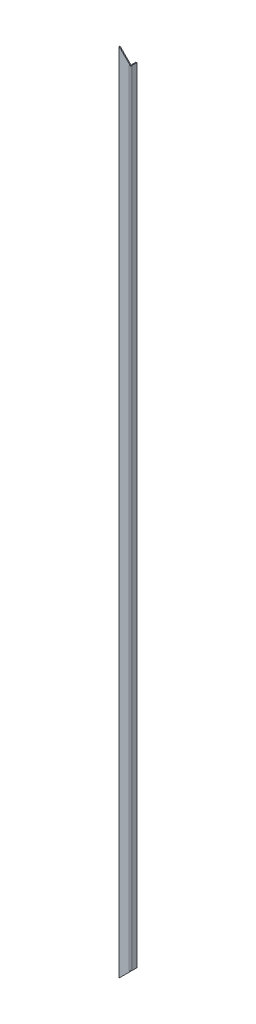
ISO-10303-21;
HEADER;
FILE_DESCRIPTION(('STEP AP214'),'2;1');
FILE_NAME('part.step','',(''),(''),'','','');
FILE_SCHEMA(('AUTOMOTIVE_DESIGN { 1 0 10303 214 1 1 1 1 }'));
ENDSEC;
DATA;
#1=APPLICATION_CONTEXT('core data for automotive mechanical design processes');
#2=APPLICATION_PROTOCOL_DEFINITION('international standard','automotive_design',2000,#1);
#3=PRODUCT_CONTEXT('',#1,'mechanical');
#4=PRODUCT('Part','Part','',(#3));
#5=PRODUCT_RELATED_PRODUCT_CATEGORY('part','',(#4));
#6=PRODUCT_DEFINITION_FORMATION('','',#4);
#7=PRODUCT_DEFINITION_CONTEXT('part definition',#1,'design');
#8=PRODUCT_DEFINITION('design','',#6,#7);
#9=PRODUCT_DEFINITION_SHAPE('','',#8);
#10=(LENGTH_UNIT() NAMED_UNIT(*) SI_UNIT(.MILLI.,.METRE.));
#11=(NAMED_UNIT(*) PLANE_ANGLE_UNIT() SI_UNIT($,.RADIAN.));
#12=(NAMED_UNIT(*) SI_UNIT($,.STERADIAN.) SOLID_ANGLE_UNIT());
#13=UNCERTAINTY_MEASURE_WITH_UNIT(LENGTH_MEASURE(1.E-05),#10,'distance_accuracy_value','');
#14=(GEOMETRIC_REPRESENTATION_CONTEXT(3) GLOBAL_UNCERTAINTY_ASSIGNED_CONTEXT((#13)) GLOBAL_UNIT_ASSIGNED_CONTEXT((#10,
#11,#12)) REPRESENTATION_CONTEXT('',''));
#15=CARTESIAN_POINT('',(0.,0.,0.));
#16=DIRECTION('',(0.,0.,1.));
#17=DIRECTION('',(1.,0.,0.));
#18=AXIS2_PLACEMENT_3D('',#15,#16,#17);
#19=CARTESIAN_POINT('',(-145.499999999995,-689.5,0.));
#20=DIRECTION('',(0.,1.,0.));
#21=DIRECTION('',(0.,0.,1.));
#22=AXIS2_PLACEMENT_3D('',#19,#20,#21);
#23=PLANE('',#22);
#24=DIRECTION('',(-1.,0.,0.));
#25=VECTOR('',#24,1.);
#26=CARTESIAN_POINT('',(-145.499999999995,-689.5,0.));
#27=LINE('',#26,#25);
#28=CARTESIAN_POINT('',(-145.499999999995,-689.5,0.));
#29=VERTEX_POINT('',#28);
#30=CARTESIAN_POINT('',(-145.708712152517,-689.5,0.));
#31=VERTEX_POINT('',#30);
#32=EDGE_CURVE('E206',#29,#31,#27,.T.);
#33=ORIENTED_EDGE('',*,*,#32,.T.);
#34=CARTESIAN_POINT('',(-147.999999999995,-689.5,-1.00000000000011));
#35=DIRECTION('',(0.,-1.,0.));
#36=DIRECTION('',(0.,0.,-1.));
#37=AXIS2_PLACEMENT_3D('',#34,#35,#36);
#38=CIRCLE('',#37,2.5);
#39=CARTESIAN_POINT('',(-147.999999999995,-689.5,1.5));
#40=VERTEX_POINT('',#39);
#41=EDGE_CURVE('E13',#31,#40,#38,.T.);
#42=ORIENTED_EDGE('',*,*,#41,.T.);
#43=DIRECTION('',(-1.,0.,0.));
#44=VECTOR('',#43,1.);
#45=CARTESIAN_POINT('',(0.,-689.5,1.5));
#46=LINE('',#45,#44);
#47=CARTESIAN_POINT('',(-145.499999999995,-689.5,1.5));
#48=VERTEX_POINT('',#47);
#49=EDGE_CURVE('E213',#48,#40,#46,.T.);
#50=ORIENTED_EDGE('',*,*,#49,.F.);
#51=DIRECTION('',(0.,0.,-1.));
#52=VECTOR('',#51,1.);
#53=CARTESIAN_POINT('',(-145.499999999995,-689.5,1.5));
#54=LINE('',#53,#52);
#55=EDGE_CURVE('E223',#48,#29,#54,.T.);
#56=ORIENTED_EDGE('',*,*,#55,.T.);
#57=EDGE_LOOP('',(#33,#42,#50,#56));
#58=FACE_BOUND('',#57,.T.);
#59=ADVANCED_FACE('F58',(#58),#23,.T.);
#60=CARTESIAN_POINT('',(-147.999999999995,689.499999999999,0.));
#61=DIRECTION('',(0.,-1.,0.));
#62=DIRECTION('',(1.,0.,0.));
#63=AXIS2_PLACEMENT_3D('',#60,#61,#62);
#64=PLANE('',#63);
#65=DIRECTION('',(1.,0.,0.));
#66=VECTOR('',#65,1.);
#67=CARTESIAN_POINT('',(-3.0619951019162E-11,689.500000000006,1.5));
#68=LINE('',#67,#66);
#69=CARTESIAN_POINT('',(-147.999999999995,689.499999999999,1.5));
#70=VERTEX_POINT('',#69);
#71=CARTESIAN_POINT('',(-145.499999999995,689.499999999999,1.5));
#72=VERTEX_POINT('',#71);
#73=EDGE_CURVE('E208',#70,#72,#68,.T.);
#74=ORIENTED_EDGE('',*,*,#73,.F.);
#75=CARTESIAN_POINT('',(-147.999999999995,689.499999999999,-0.999999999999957));
#76=DIRECTION('',(0.,-1.,0.));
#77=DIRECTION('',(0.,0.,-1.));
#78=AXIS2_PLACEMENT_3D('',#75,#76,#77);
#79=CIRCLE('',#78,2.5);
#80=CARTESIAN_POINT('',(-145.708712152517,689.499999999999,0.));
#81=VERTEX_POINT('',#80);
#82=EDGE_CURVE('E196',#70,#81,#79,.F.);
#83=ORIENTED_EDGE('',*,*,#82,.T.);
#84=DIRECTION('',(1.,0.,0.));
#85=VECTOR('',#84,1.);
#86=CARTESIAN_POINT('',(-147.999999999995,689.499999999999,0.));
#87=LINE('',#86,#85);
#88=CARTESIAN_POINT('',(-145.499999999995,689.499999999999,0.));
#89=VERTEX_POINT('',#88);
#90=EDGE_CURVE('E198',#81,#89,#87,.T.);
#91=ORIENTED_EDGE('',*,*,#90,.T.);
#92=DIRECTION('',(0.,0.,-1.));
#93=VECTOR('',#92,1.);
#94=CARTESIAN_POINT('',(-145.499999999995,689.499999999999,1.5));
#95=LINE('',#94,#93);
#96=EDGE_CURVE('E62',#72,#89,#95,.T.);
#97=ORIENTED_EDGE('',*,*,#96,.F.);
#98=EDGE_LOOP('',(#74,#83,#91,#97));
#99=FACE_BOUND('',#98,.T.);
#100=ADVANCED_FACE('F257',(#99),#64,.T.);
#101=CARTESIAN_POINT('',(0.,0.,1.5));
#102=DIRECTION('',(0.,0.,1.));
#103=DIRECTION('',(1.,0.,0.));
#104=AXIS2_PLACEMENT_3D('',#101,#102,#103);
#105=PLANE('',#104);
#106=DIRECTION('',(0.707106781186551,0.707106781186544,0.));
#107=VECTOR('',#106,1.);
#108=CARTESIAN_POINT('',(-145.499999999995,-689.5,1.5));
#109=LINE('',#108,#107);
#110=CARTESIAN_POINT('',(-165.499999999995,-709.5,1.5));
#111=VERTEX_POINT('',#110);
#112=EDGE_CURVE('E221',#111,#48,#109,.T.);
#113=ORIENTED_EDGE('',*,*,#112,.T.);
#114=ORIENTED_EDGE('',*,*,#49,.T.);
#115=DIRECTION('',(0.,-1.,0.));
#116=VECTOR('',#115,1.);
#117=CARTESIAN_POINT('',(-147.999999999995,-689.5,1.49999999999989));
#118=LINE('',#117,#116);
#119=EDGE_CURVE('E150',#40,#70,#118,.F.);
#120=ORIENTED_EDGE('',*,*,#119,.T.);
#121=ORIENTED_EDGE('',*,*,#73,.T.);
#122=DIRECTION('',(-0.707106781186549,0.707106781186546,0.));
#123=VECTOR('',#122,1.);
#124=CARTESIAN_POINT('',(-145.499999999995,689.499999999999,1.5));
#125=LINE('',#124,#123);
#126=CARTESIAN_POINT('',(-165.499999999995,709.499999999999,1.5));
#127=VERTEX_POINT('',#126);
#128=EDGE_CURVE('E216',#72,#127,#125,.T.);
#129=ORIENTED_EDGE('',*,*,#128,.T.);
#130=DIRECTION('',(0.,-1.,0.));
#131=VECTOR('',#130,1.);
#132=CARTESIAN_POINT('',(-165.499999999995,-709.5,1.5));
#133=LINE('',#132,#131);
#134=EDGE_CURVE('E218',#127,#111,#133,.T.);
#135=ORIENTED_EDGE('',*,*,#134,.T.);
#136=EDGE_LOOP('',(#113,#114,#120,#121,#129,#135));
#137=FACE_BOUND('',#136,.T.);
#138=ADVANCED_FACE('F255',(#137),#105,.T.);
#139=CARTESIAN_POINT('',(0.,0.,0.));
#140=DIRECTION('',(0.,0.,1.));
#141=DIRECTION('',(1.,0.,0.));
#142=AXIS2_PLACEMENT_3D('',#139,#140,#141);
#143=PLANE('',#142);
#144=ORIENTED_EDGE('',*,*,#32,.F.);
#145=DIRECTION('',(0.707106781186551,0.707106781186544,0.));
#146=VECTOR('',#145,1.);
#147=CARTESIAN_POINT('',(-145.499999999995,-689.5,0.));
#148=LINE('',#147,#146);
#149=CARTESIAN_POINT('',(-165.499999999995,-709.5,0.));
#150=VERTEX_POINT('',#149);
#151=EDGE_CURVE('E219',#150,#29,#148,.T.);
#152=ORIENTED_EDGE('',*,*,#151,.F.);
#153=DIRECTION('',(0.,-1.,0.));
#154=VECTOR('',#153,1.);
#155=CARTESIAN_POINT('',(-165.499999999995,-709.5,0.));
#156=LINE('',#155,#154);
#157=CARTESIAN_POINT('',(-165.499999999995,709.499999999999,0.));
#158=VERTEX_POINT('',#157);
#159=EDGE_CURVE('E225',#158,#150,#156,.T.);
#160=ORIENTED_EDGE('',*,*,#159,.F.);
#161=DIRECTION('',(-0.707106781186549,0.707106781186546,0.));
#162=VECTOR('',#161,1.);
#163=CARTESIAN_POINT('',(-145.499999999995,689.499999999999,0.));
#164=LINE('',#163,#162);
#165=EDGE_CURVE('E215',#89,#158,#164,.T.);
#166=ORIENTED_EDGE('',*,*,#165,.F.);
#167=ORIENTED_EDGE('',*,*,#90,.F.);
#168=CARTESIAN_POINT('',(-147.999999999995,689.499999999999,0.));
#169=VERTEX_POINT('',#168);
#170=EDGE_CURVE('E209',#169,#81,#87,.T.);
#171=ORIENTED_EDGE('',*,*,#170,.F.);
#172=DIRECTION('',(0.,-1.,0.));
#173=VECTOR('',#172,1.);
#174=CARTESIAN_POINT('',(-147.999999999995,-689.5,-1.05384451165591E-13));
#175=LINE('',#174,#173);
#176=CARTESIAN_POINT('',(-147.999999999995,-689.5,0.));
#177=VERTEX_POINT('',#176);
#178=EDGE_CURVE('E202',#177,#169,#175,.F.);
#179=ORIENTED_EDGE('',*,*,#178,.F.);
#180=EDGE_CURVE('E75',#31,#177,#27,.T.);
#181=ORIENTED_EDGE('',*,*,#180,.F.);
#182=EDGE_LOOP('',(#144,#152,#160,#166,#167,#171,#179,#181));
#183=FACE_BOUND('',#182,.T.);
#184=ADVANCED_FACE('F246',(#183),#143,.F.);
#185=CARTESIAN_POINT('',(-145.499999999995,689.499999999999,1.5));
#186=DIRECTION('',(-0.707106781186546,-0.707106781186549,0.));
#187=DIRECTION('',(0.707106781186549,-0.707106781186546,0.));
#188=AXIS2_PLACEMENT_3D('',#185,#186,#187);
#189=PLANE('',#188);
#190=ORIENTED_EDGE('',*,*,#165,.T.);
#191=DIRECTION('',(0.,0.,-1.));
#192=VECTOR('',#191,1.);
#193=CARTESIAN_POINT('',(-165.499999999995,709.499999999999,1.5));
#194=LINE('',#193,#192);
#195=EDGE_CURVE('E233',#127,#158,#194,.T.);
#196=ORIENTED_EDGE('',*,*,#195,.F.);
#197=ORIENTED_EDGE('',*,*,#128,.F.);
#198=ORIENTED_EDGE('',*,*,#96,.T.);
#199=EDGE_LOOP('',(#190,#196,#197,#198));
#200=FACE_BOUND('',#199,.T.);
#201=ADVANCED_FACE('F60',(#200),#189,.F.);
#202=CARTESIAN_POINT('',(-165.499999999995,-709.5,1.5));
#203=DIRECTION('',(1.,0.,0.));
#204=DIRECTION('',(0.,0.,-1.));
#205=AXIS2_PLACEMENT_3D('',#202,#203,#204);
#206=PLANE('',#205);
#207=ORIENTED_EDGE('',*,*,#159,.T.);
#208=DIRECTION('',(0.,0.,-1.));
#209=VECTOR('',#208,1.);
#210=CARTESIAN_POINT('',(-165.499999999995,-709.5,1.5));
#211=LINE('',#210,#209);
#212=EDGE_CURVE('E231',#111,#150,#211,.T.);
#213=ORIENTED_EDGE('',*,*,#212,.F.);
#214=ORIENTED_EDGE('',*,*,#134,.F.);
#215=ORIENTED_EDGE('',*,*,#195,.T.);
#216=EDGE_LOOP('',(#207,#213,#214,#215));
#217=FACE_BOUND('',#216,.T.);
#218=ADVANCED_FACE('F249',(#217),#206,.F.);
#219=CARTESIAN_POINT('',(-145.499999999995,-689.5,1.5));
#220=DIRECTION('',(-0.707106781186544,0.707106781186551,0.));
#221=DIRECTION('',(-0.707106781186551,-0.707106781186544,0.));
#222=AXIS2_PLACEMENT_3D('',#219,#220,#221);
#223=PLANE('',#222);
#224=ORIENTED_EDGE('',*,*,#151,.T.);
#225=ORIENTED_EDGE('',*,*,#55,.F.);
#226=ORIENTED_EDGE('',*,*,#112,.F.);
#227=ORIENTED_EDGE('',*,*,#212,.T.);
#228=EDGE_LOOP('',(#224,#225,#226,#227));
#229=FACE_BOUND('',#228,.T.);
#230=ADVANCED_FACE('F252',(#229),#223,.F.);
#231=CARTESIAN_POINT('',(-147.999999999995,689.499999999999,-0.999999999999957));
#232=DIRECTION('',(0.,1.,0.));
#233=DIRECTION('',(0.,0.,1.));
#234=AXIS2_PLACEMENT_3D('',#231,#232,#233);
#235=PLANE('',#234);
#236=CARTESIAN_POINT('',(-147.999999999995,689.499999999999,-0.999999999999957));
#237=DIRECTION('',(0.,-1.,0.));
#238=DIRECTION('',(0.,0.,-1.));
#239=AXIS2_PLACEMENT_3D('',#236,#237,#238);
#240=CIRCLE('',#239,1.);
#241=CARTESIAN_POINT('',(-146.999999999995,689.499999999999,-0.999999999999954));
#242=VERTEX_POINT('',#241);
#243=EDGE_CURVE('E151',#169,#242,#240,.F.);
#244=ORIENTED_EDGE('',*,*,#243,.F.);
#245=ORIENTED_EDGE('',*,*,#170,.T.);
#246=CARTESIAN_POINT('',(-145.499999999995,689.499999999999,-0.999999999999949));
#247=VERTEX_POINT('',#246);
#248=EDGE_CURVE('E195',#81,#247,#79,.F.);
#249=ORIENTED_EDGE('',*,*,#248,.T.);
#250=DIRECTION('',(1.,0.,0.));
#251=VECTOR('',#250,1.);
#252=CARTESIAN_POINT('',(-145.499999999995,689.499999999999,-0.999999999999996));
#253=LINE('',#252,#251);
#254=EDGE_CURVE('E192',#242,#247,#253,.T.);
#255=ORIENTED_EDGE('',*,*,#254,.F.);
#256=EDGE_LOOP('',(#244,#245,#249,#255));
#257=FACE_BOUND('',#256,.T.);
#258=ADVANCED_FACE('F260',(#257),#235,.T.);
#259=CARTESIAN_POINT('',(-147.999999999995,-689.5,-1.00000000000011));
#260=DIRECTION('',(0.,1.,0.));
#261=DIRECTION('',(0.,0.,1.));
#262=AXIS2_PLACEMENT_3D('',#259,#260,#261);
#263=PLANE('',#262);
#264=CARTESIAN_POINT('',(-145.499999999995,-689.5,-1.00000000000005));
#265=VERTEX_POINT('',#264);
#266=EDGE_CURVE('E68',#265,#31,#38,.T.);
#267=ORIENTED_EDGE('',*,*,#266,.T.);
#268=ORIENTED_EDGE('',*,*,#180,.T.);
#269=CARTESIAN_POINT('',(-147.999999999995,-689.5,-1.00000000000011));
#270=DIRECTION('',(0.,-1.,0.));
#271=DIRECTION('',(0.,0.,-1.));
#272=AXIS2_PLACEMENT_3D('',#269,#270,#271);
#273=CIRCLE('',#272,1.);
#274=CARTESIAN_POINT('',(-146.999999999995,-689.5,-1.0000000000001));
#275=VERTEX_POINT('',#274);
#276=EDGE_CURVE('E157',#275,#177,#273,.T.);
#277=ORIENTED_EDGE('',*,*,#276,.F.);
#278=DIRECTION('',(1.,0.,0.));
#279=VECTOR('',#278,1.);
#280=CARTESIAN_POINT('',(-146.999999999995,-689.5,-1.00000000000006));
#281=LINE('',#280,#279);
#282=EDGE_CURVE('E154',#275,#265,#281,.T.);
#283=ORIENTED_EDGE('',*,*,#282,.T.);
#284=EDGE_LOOP('',(#267,#268,#277,#283));
#285=FACE_BOUND('',#284,.T.);
#286=ADVANCED_FACE('F155',(#285),#263,.F.);
#287=CARTESIAN_POINT('',(-147.999999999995,-689.5,-1.00000000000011));
#288=DIRECTION('',(0.,-1.,0.));
#289=DIRECTION('',(1.,0.,0.));
#290=AXIS2_PLACEMENT_3D('',#287,#288,#289);
#291=CYLINDRICAL_SURFACE('',#290,2.5);
#292=ORIENTED_EDGE('',*,*,#119,.F.);
#293=ORIENTED_EDGE('',*,*,#41,.F.);
#294=ORIENTED_EDGE('',*,*,#266,.F.);
#295=DIRECTION('',(0.,-1.,0.));
#296=VECTOR('',#295,1.);
#297=CARTESIAN_POINT('',(-145.499999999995,0.,-1.00000000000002));
#298=LINE('',#297,#296);
#299=EDGE_CURVE('E147',#247,#265,#298,.T.);
#300=ORIENTED_EDGE('',*,*,#299,.F.);
#301=ORIENTED_EDGE('',*,*,#248,.F.);
#302=ORIENTED_EDGE('',*,*,#82,.F.);
#303=EDGE_LOOP('',(#292,#293,#294,#300,#301,#302));
#304=FACE_BOUND('',#303,.T.);
#305=ADVANCED_FACE('F144',(#304),#291,.T.);
#306=CARTESIAN_POINT('',(-147.999999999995,-689.5,-1.00000000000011));
#307=DIRECTION('',(0.,-1.,0.));
#308=DIRECTION('',(1.,0.,0.));
#309=AXIS2_PLACEMENT_3D('',#306,#307,#308);
#310=CYLINDRICAL_SURFACE('',#309,1.);
#311=ORIENTED_EDGE('',*,*,#178,.T.);
#312=ORIENTED_EDGE('',*,*,#243,.T.);
#313=DIRECTION('',(0.,1.,0.));
#314=VECTOR('',#313,1.);
#315=CARTESIAN_POINT('',(-146.999999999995,689.499999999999,-1.));
#316=LINE('',#315,#314);
#317=EDGE_CURVE('E162',#242,#275,#316,.F.);
#318=ORIENTED_EDGE('',*,*,#317,.T.);
#319=ORIENTED_EDGE('',*,*,#276,.T.);
#320=EDGE_LOOP('',(#311,#312,#318,#319));
#321=FACE_BOUND('',#320,.T.);
#322=ADVANCED_FACE('F262',(#321),#310,.F.);
#323=CARTESIAN_POINT('',(-145.499999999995,-689.5,0.));
#324=DIRECTION('',(0.,-1.,0.));
#325=DIRECTION('',(0.,0.,-1.));
#326=AXIS2_PLACEMENT_3D('',#323,#324,#325);
#327=PLANE('',#326);
#328=DIRECTION('',(0.,0.,1.));
#329=VECTOR('',#328,1.);
#330=CARTESIAN_POINT('',(-145.499999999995,-689.5,0.));
#331=LINE('',#330,#329);
#332=CARTESIAN_POINT('',(-145.499999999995,-689.5,-9.5));
#333=VERTEX_POINT('',#332);
#334=EDGE_CURVE('E169',#333,#265,#331,.T.);
#335=ORIENTED_EDGE('',*,*,#334,.T.);
#336=ORIENTED_EDGE('',*,*,#282,.F.);
#337=DIRECTION('',(0.,0.,-1.));
#338=VECTOR('',#337,1.);
#339=CARTESIAN_POINT('',(-146.999999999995,-689.5,-4.25098552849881E-13));
#340=LINE('',#339,#338);
#341=CARTESIAN_POINT('',(-146.999999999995,-689.5,-9.50000000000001));
#342=VERTEX_POINT('',#341);
#343=EDGE_CURVE('E185',#342,#275,#340,.F.);
#344=ORIENTED_EDGE('',*,*,#343,.F.);
#345=DIRECTION('',(-1.,0.,0.));
#346=VECTOR('',#345,1.);
#347=CARTESIAN_POINT('',(-145.499999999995,-689.5,-9.5));
#348=LINE('',#347,#346);
#349=EDGE_CURVE('E174',#333,#342,#348,.T.);
#350=ORIENTED_EDGE('',*,*,#349,.F.);
#351=EDGE_LOOP('',(#335,#336,#344,#350));
#352=FACE_BOUND('',#351,.T.);
#353=ADVANCED_FACE('F173',(#352),#327,.T.);
#354=CARTESIAN_POINT('',(-145.499999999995,689.499999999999,-9.5));
#355=DIRECTION('',(0.,1.,0.));
#356=DIRECTION('',(0.,0.,1.));
#357=AXIS2_PLACEMENT_3D('',#354,#355,#356);
#358=PLANE('',#357);
#359=DIRECTION('',(0.,0.,1.));
#360=VECTOR('',#359,1.);
#361=CARTESIAN_POINT('',(-146.999999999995,689.499999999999,-4.25098552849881E-13));
#362=LINE('',#361,#360);
#363=CARTESIAN_POINT('',(-146.999999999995,689.499999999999,-9.50000000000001));
#364=VERTEX_POINT('',#363);
#365=EDGE_CURVE('E171',#242,#364,#362,.F.);
#366=ORIENTED_EDGE('',*,*,#365,.F.);
#367=ORIENTED_EDGE('',*,*,#254,.T.);
#368=DIRECTION('',(0.,0.,-1.));
#369=VECTOR('',#368,1.);
#370=CARTESIAN_POINT('',(-145.499999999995,689.499999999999,-9.5));
#371=LINE('',#370,#369);
#372=CARTESIAN_POINT('',(-145.499999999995,689.499999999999,-9.5));
#373=VERTEX_POINT('',#372);
#374=EDGE_CURVE('E170',#247,#373,#371,.T.);
#375=ORIENTED_EDGE('',*,*,#374,.T.);
#376=DIRECTION('',(-1.,0.,0.));
#377=VECTOR('',#376,1.);
#378=CARTESIAN_POINT('',(-145.499999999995,689.499999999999,-9.5));
#379=LINE('',#378,#377);
#380=EDGE_CURVE('E176',#373,#364,#379,.T.);
#381=ORIENTED_EDGE('',*,*,#380,.T.);
#382=EDGE_LOOP('',(#366,#367,#375,#381));
#383=FACE_BOUND('',#382,.T.);
#384=ADVANCED_FACE('F268',(#383),#358,.T.);
#385=CARTESIAN_POINT('',(-145.499999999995,0.,-4.19861330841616E-13));
#386=DIRECTION('',(1.,0.,0.));
#387=DIRECTION('',(0.,0.,-1.));
#388=AXIS2_PLACEMENT_3D('',#385,#386,#387);
#389=PLANE('',#388);
#390=ORIENTED_EDGE('',*,*,#374,.F.);
#391=ORIENTED_EDGE('',*,*,#299,.T.);
#392=ORIENTED_EDGE('',*,*,#334,.F.);
#393=DIRECTION('',(0.,-1.,0.));
#394=VECTOR('',#393,1.);
#395=CARTESIAN_POINT('',(-145.499999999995,-689.5,-9.5));
#396=LINE('',#395,#394);
#397=EDGE_CURVE('E177',#373,#333,#396,.T.);
#398=ORIENTED_EDGE('',*,*,#397,.F.);
#399=EDGE_LOOP('',(#390,#391,#392,#398));
#400=FACE_BOUND('',#399,.T.);
#401=ADVANCED_FACE('F167',(#400),#389,.T.);
#402=CARTESIAN_POINT('',(-146.999999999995,0.,-4.25098552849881E-13));
#403=DIRECTION('',(1.,0.,0.));
#404=DIRECTION('',(0.,0.,-1.));
#405=AXIS2_PLACEMENT_3D('',#402,#403,#404);
#406=PLANE('',#405);
#407=ORIENTED_EDGE('',*,*,#317,.F.);
#408=ORIENTED_EDGE('',*,*,#365,.T.);
#409=DIRECTION('',(0.,1.,0.));
#410=VECTOR('',#409,1.);
#411=CARTESIAN_POINT('',(-146.999999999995,0.,-9.50000000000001));
#412=LINE('',#411,#410);
#413=EDGE_CURVE('E187',#364,#342,#412,.F.);
#414=ORIENTED_EDGE('',*,*,#413,.T.);
#415=ORIENTED_EDGE('',*,*,#343,.T.);
#416=EDGE_LOOP('',(#407,#408,#414,#415));
#417=FACE_BOUND('',#416,.T.);
#418=ADVANCED_FACE('F266',(#417),#406,.F.);
#419=CARTESIAN_POINT('',(-145.499999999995,-689.5,-9.5));
#420=DIRECTION('',(0.,0.,-1.));
#421=DIRECTION('',(-1.,0.,0.));
#422=AXIS2_PLACEMENT_3D('',#419,#420,#421);
#423=PLANE('',#422);
#424=ORIENTED_EDGE('',*,*,#413,.F.);
#425=ORIENTED_EDGE('',*,*,#380,.F.);
#426=ORIENTED_EDGE('',*,*,#397,.T.);
#427=ORIENTED_EDGE('',*,*,#349,.T.);
#428=EDGE_LOOP('',(#424,#425,#426,#427));
#429=FACE_BOUND('',#428,.T.);
#430=ADVANCED_FACE('F272',(#429),#423,.T.);
#431=CLOSED_SHELL('',(#59,#100,#138,#184,#201,#218,#230,#258,#286,#305,#322,#353,#384,#401,#418,#430));
#432=MANIFOLD_SOLID_BREP('B2',#431);
#433=ADVANCED_BREP_SHAPE_REPRESENTATION('',(#18,#432),#14);
#434=SHAPE_DEFINITION_REPRESENTATION(#9,#433);
ENDSEC;
END-ISO-10303-21;
